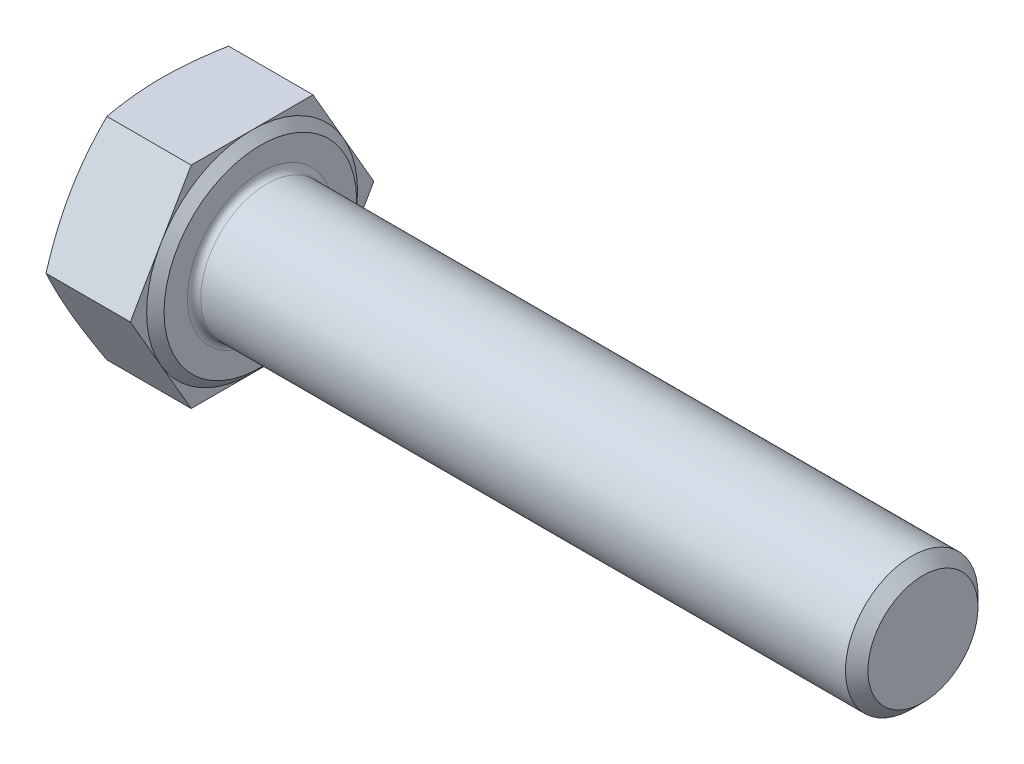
ISO-10303-21;
HEADER;
FILE_DESCRIPTION(('STEP AP214'),'2;1');
FILE_NAME('part.step','',(''),(''),'','','');
FILE_SCHEMA(('AUTOMOTIVE_DESIGN { 1 0 10303 214 1 1 1 1 }'));
ENDSEC;
DATA;
#1=APPLICATION_CONTEXT('core data for automotive mechanical design processes');
#2=APPLICATION_PROTOCOL_DEFINITION('international standard','automotive_design',2000,#1);
#3=PRODUCT_CONTEXT('',#1,'mechanical');
#4=PRODUCT('Part','Part','',(#3));
#5=PRODUCT_RELATED_PRODUCT_CATEGORY('part','',(#4));
#6=PRODUCT_DEFINITION_FORMATION('','',#4);
#7=PRODUCT_DEFINITION_CONTEXT('part definition',#1,'design');
#8=PRODUCT_DEFINITION('design','',#6,#7);
#9=PRODUCT_DEFINITION_SHAPE('','',#8);
#10=(LENGTH_UNIT() NAMED_UNIT(*) SI_UNIT(.MILLI.,.METRE.));
#11=(NAMED_UNIT(*) PLANE_ANGLE_UNIT() SI_UNIT($,.RADIAN.));
#12=(NAMED_UNIT(*) SI_UNIT($,.STERADIAN.) SOLID_ANGLE_UNIT());
#13=UNCERTAINTY_MEASURE_WITH_UNIT(LENGTH_MEASURE(1.E-05),#10,'distance_accuracy_value','');
#14=(GEOMETRIC_REPRESENTATION_CONTEXT(3) GLOBAL_UNCERTAINTY_ASSIGNED_CONTEXT((#13)) GLOBAL_UNIT_ASSIGNED_CONTEXT((#10,
#11,#12)) REPRESENTATION_CONTEXT('',''));
#15=CARTESIAN_POINT('',(0.,0.,0.));
#16=DIRECTION('',(0.,0.,1.));
#17=DIRECTION('',(1.,0.,0.));
#18=AXIS2_PLACEMENT_3D('',#15,#16,#17);
#19=CARTESIAN_POINT('',(5.95,0.,0.));
#20=DIRECTION('',(1.,0.,0.));
#21=DIRECTION('',(0.,0.,-1.));
#22=AXIS2_PLACEMENT_3D('',#19,#20,#21);
#23=PLANE('',#22);
#24=CARTESIAN_POINT('',(5.95,0.,0.));
#25=DIRECTION('',(1.,0.,0.));
#26=DIRECTION('',(0.,0.,-1.));
#27=AXIS2_PLACEMENT_3D('',#24,#25,#26);
#28=CIRCLE('',#27,4.4);
#29=CARTESIAN_POINT('',(5.95,0.,-4.4));
#30=VERTEX_POINT('',#29);
#31=EDGE_CURVE('E188',#30,#30,#28,.F.);
#32=ORIENTED_EDGE('',*,*,#31,.T.);
#33=EDGE_LOOP('',(#32));
#34=FACE_BOUND('',#33,.T.);
#35=CARTESIAN_POINT('',(5.95,0.,0.));
#36=DIRECTION('',(-1.,0.,0.));
#37=DIRECTION('',(0.,0.,1.));
#38=AXIS2_PLACEMENT_3D('',#35,#36,#37);
#39=CIRCLE('',#38,5.815);
#40=CARTESIAN_POINT('',(5.95,0.,5.815));
#41=VERTEX_POINT('',#40);
#42=EDGE_CURVE('E139',#41,#41,#39,.T.);
#43=ORIENTED_EDGE('',*,*,#42,.F.);
#44=EDGE_LOOP('',(#43));
#45=FACE_BOUND('',#44,.T.);
#46=ADVANCED_FACE('F33',(#34,#45),#23,.T.);
#47=CARTESIAN_POINT('',(5.45,0.,-7.34966892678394));
#48=DIRECTION('',(1.,0.,0.));
#49=DIRECTION('',(0.,0.,-1.));
#50=AXIS2_PLACEMENT_3D('',#47,#48,#49);
#51=PLANE('',#50);
#52=DIRECTION('',(0.,-0.866025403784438,0.5));
#53=VECTOR('',#52,1.);
#54=CARTESIAN_POINT('',(5.45,6.365,3.67483446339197));
#55=LINE('',#54,#53);
#56=CARTESIAN_POINT('',(5.45,6.365,3.67483446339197));
#57=VERTEX_POINT('',#56);
#58=CARTESIAN_POINT('',(5.45,3.1825,5.51225169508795));
#59=VERTEX_POINT('',#58);
#60=EDGE_CURVE('E138',#57,#59,#55,.T.);
#61=ORIENTED_EDGE('',*,*,#60,.T.);
#62=CARTESIAN_POINT('',(5.45,0.,0.));
#63=DIRECTION('',(-1.,0.,0.));
#64=DIRECTION('',(0.,0.,1.));
#65=AXIS2_PLACEMENT_3D('',#62,#63,#64);
#66=CIRCLE('',#65,6.365);
#67=CARTESIAN_POINT('',(5.45,6.365,0.));
#68=VERTEX_POINT('',#67);
#69=EDGE_CURVE('E49',#59,#68,#66,.T.);
#70=ORIENTED_EDGE('',*,*,#69,.T.);
#71=DIRECTION('',(0.,0.,1.));
#72=VECTOR('',#71,1.);
#73=CARTESIAN_POINT('',(5.45,6.365,-3.67483446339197));
#74=LINE('',#73,#72);
#75=EDGE_CURVE('E135',#68,#57,#74,.T.);
#76=ORIENTED_EDGE('',*,*,#75,.T.);
#77=EDGE_LOOP('',(#61,#70,#76));
#78=FACE_BOUND('',#77,.T.);
#79=ADVANCED_FACE('F134',(#78),#51,.T.);
#80=CARTESIAN_POINT('',(5.45,6.365,-3.67483446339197));
#81=VERTEX_POINT('',#80);
#82=EDGE_CURVE('E145',#81,#68,#74,.T.);
#83=ORIENTED_EDGE('',*,*,#82,.T.);
#84=CARTESIAN_POINT('',(5.45,3.1825,-5.51225169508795));
#85=VERTEX_POINT('',#84);
#86=EDGE_CURVE('E122',#68,#85,#66,.T.);
#87=ORIENTED_EDGE('',*,*,#86,.T.);
#88=DIRECTION('',(0.,0.866025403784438,0.5));
#89=VECTOR('',#88,1.);
#90=CARTESIAN_POINT('',(5.45,0.,-7.34966892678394));
#91=LINE('',#90,#89);
#92=EDGE_CURVE('E151',#85,#81,#91,.T.);
#93=ORIENTED_EDGE('',*,*,#92,.T.);
#94=EDGE_LOOP('',(#83,#87,#93));
#95=FACE_BOUND('',#94,.T.);
#96=ADVANCED_FACE('F150',(#95),#51,.T.);
#97=CARTESIAN_POINT('',(5.45,0.,-7.34966892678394));
#98=VERTEX_POINT('',#97);
#99=EDGE_CURVE('E148',#98,#85,#91,.T.);
#100=ORIENTED_EDGE('',*,*,#99,.T.);
#101=CARTESIAN_POINT('',(5.45,-3.1825,-5.51225169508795));
#102=VERTEX_POINT('',#101);
#103=EDGE_CURVE('E125',#85,#102,#66,.T.);
#104=ORIENTED_EDGE('',*,*,#103,.T.);
#105=DIRECTION('',(0.,0.866025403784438,-0.5));
#106=VECTOR('',#105,1.);
#107=CARTESIAN_POINT('',(5.45,-6.365,-3.67483446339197));
#108=LINE('',#107,#106);
#109=EDGE_CURVE('E306',#102,#98,#108,.T.);
#110=ORIENTED_EDGE('',*,*,#109,.T.);
#111=EDGE_LOOP('',(#100,#104,#110));
#112=FACE_BOUND('',#111,.T.);
#113=ADVANCED_FACE('F337',(#112),#51,.T.);
#114=CARTESIAN_POINT('',(5.45,-6.365,-3.67483446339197));
#115=VERTEX_POINT('',#114);
#116=EDGE_CURVE('E304',#115,#102,#108,.T.);
#117=ORIENTED_EDGE('',*,*,#116,.T.);
#118=CARTESIAN_POINT('',(5.45,-6.365,0.));
#119=VERTEX_POINT('',#118);
#120=EDGE_CURVE('E338',#102,#119,#66,.T.);
#121=ORIENTED_EDGE('',*,*,#120,.T.);
#122=DIRECTION('',(0.,0.,-1.));
#123=VECTOR('',#122,1.);
#124=CARTESIAN_POINT('',(5.45,-6.365,3.67483446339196));
#125=LINE('',#124,#123);
#126=EDGE_CURVE('E162',#119,#115,#125,.T.);
#127=ORIENTED_EDGE('',*,*,#126,.T.);
#128=EDGE_LOOP('',(#117,#121,#127));
#129=FACE_BOUND('',#128,.T.);
#130=ADVANCED_FACE('F352',(#129),#51,.T.);
#131=CARTESIAN_POINT('',(5.45,-6.365,3.67483446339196));
#132=VERTEX_POINT('',#131);
#133=EDGE_CURVE('E163',#132,#119,#125,.T.);
#134=ORIENTED_EDGE('',*,*,#133,.T.);
#135=CARTESIAN_POINT('',(5.45,-3.1825,5.51225169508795));
#136=VERTEX_POINT('',#135);
#137=EDGE_CURVE('E339',#119,#136,#66,.T.);
#138=ORIENTED_EDGE('',*,*,#137,.T.);
#139=DIRECTION('',(0.,-0.866025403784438,-0.5));
#140=VECTOR('',#139,1.);
#141=CARTESIAN_POINT('',(5.45,0.,7.34966892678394));
#142=LINE('',#141,#140);
#143=EDGE_CURVE('E158',#136,#132,#142,.T.);
#144=ORIENTED_EDGE('',*,*,#143,.T.);
#145=EDGE_LOOP('',(#134,#138,#144));
#146=FACE_BOUND('',#145,.T.);
#147=ADVANCED_FACE('F347',(#146),#51,.T.);
#148=CARTESIAN_POINT('',(5.45,0.,7.34966892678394));
#149=VERTEX_POINT('',#148);
#150=EDGE_CURVE('E159',#149,#136,#142,.T.);
#151=ORIENTED_EDGE('',*,*,#150,.T.);
#152=EDGE_CURVE('E140',#136,#59,#66,.T.);
#153=ORIENTED_EDGE('',*,*,#152,.T.);
#154=EDGE_CURVE('E153',#59,#149,#55,.T.);
#155=ORIENTED_EDGE('',*,*,#154,.T.);
#156=EDGE_LOOP('',(#151,#153,#155));
#157=FACE_BOUND('',#156,.T.);
#158=ADVANCED_FACE('F213',(#157),#51,.T.);
#159=CARTESIAN_POINT('',(5.45,-6.365,-3.67483446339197));
#160=DIRECTION('',(0.,0.5,0.866025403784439));
#161=DIRECTION('',(0.,-0.866025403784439,0.5));
#162=AXIS2_PLACEMENT_3D('',#159,#160,#161);
#163=PLANE('',#162);
#164=CARTESIAN_POINT('',(0.358432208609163,0.000200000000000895,-7.34978439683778));
#165=CARTESIAN_POINT('',(0.303017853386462,-0.263405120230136,-7.19759190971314));
#166=CARTESIAN_POINT('',(0.252608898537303,-0.52787949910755,-7.04489755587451));
#167=CARTESIAN_POINT('',(0.163922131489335,-1.05854790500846,-6.73851600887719));
#168=CARTESIAN_POINT('',(0.125653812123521,-1.3247431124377,-6.58482813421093));
#169=CARTESIAN_POINT('',(0.0637558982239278,-1.85589900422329,-6.27816513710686));
#170=CARTESIAN_POINT('',(0.0399912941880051,-2.12084755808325,-6.12519701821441));
#171=CARTESIAN_POINT('',(0.00811628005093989,-2.65136425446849,-5.81890306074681));
#172=CARTESIAN_POINT('',(0.,-2.91693212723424,-5.66557737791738));
#173=CARTESIAN_POINT('',(0.,-3.44806787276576,-5.35892601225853));
#174=CARTESIAN_POINT('',(0.00811628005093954,-3.71363574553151,-5.2056003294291));
#175=CARTESIAN_POINT('',(0.0399912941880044,-4.24415244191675,-4.89930637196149));
#176=CARTESIAN_POINT('',(0.0637558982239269,-4.50910099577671,-4.74633825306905));
#177=CARTESIAN_POINT('',(0.12565381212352,-5.0402568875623,-4.43967525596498));
#178=CARTESIAN_POINT('',(0.163922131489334,-5.30645209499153,-4.28598738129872));
#179=CARTESIAN_POINT('',(0.252608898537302,-5.83712050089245,-3.9796058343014));
#180=CARTESIAN_POINT('',(0.303017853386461,-6.10159487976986,-3.82691148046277));
#181=CARTESIAN_POINT('',(0.358432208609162,-6.3652,-3.67471899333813));
#182=B_SPLINE_CURVE_WITH_KNOTS('',3,(#164,#165,#166,#167,#168,#169,#170,#171,#172,#173,#174,
#175,#176,#177,#178,#179,#180,#181),.UNSPECIFIED.,.F.,.F.,(4,2,2,2,2,2,2,2,4),(0.,
0.928259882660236,1.85724379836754,2.77744274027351,3.69729643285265,4.6171501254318,
5.53734906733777,6.46633298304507,7.39459286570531),.UNSPECIFIED.);
#183=CARTESIAN_POINT('',(0.358390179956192,0.,-7.34966892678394));
#184=VERTEX_POINT('',#183);
#185=CARTESIAN_POINT('',(0.,-3.1825,-5.51225169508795));
#186=VERTEX_POINT('',#185);
#187=EDGE_CURVE('E321',#184,#186,#182,.T.);
#188=ORIENTED_EDGE('',*,*,#187,.F.);
#189=DIRECTION('',(-1.,0.,0.));
#190=VECTOR('',#189,1.);
#191=CARTESIAN_POINT('',(5.45,0.,-7.34966892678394));
#192=LINE('',#191,#190);
#193=EDGE_CURVE('E178',#98,#184,#192,.T.);
#194=ORIENTED_EDGE('',*,*,#193,.F.);
#195=ORIENTED_EDGE('',*,*,#109,.F.);
#196=ORIENTED_EDGE('',*,*,#116,.F.);
#197=DIRECTION('',(-1.,0.,0.));
#198=VECTOR('',#197,1.);
#199=CARTESIAN_POINT('',(5.45,-6.365,-3.67483446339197));
#200=LINE('',#199,#198);
#201=CARTESIAN_POINT('',(0.358390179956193,-6.365,-3.67483446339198));
#202=VERTEX_POINT('',#201);
#203=EDGE_CURVE('E166',#115,#202,#200,.T.);
#204=ORIENTED_EDGE('',*,*,#203,.T.);
#205=EDGE_CURVE('E246',#186,#202,#182,.T.);
#206=ORIENTED_EDGE('',*,*,#205,.F.);
#207=EDGE_LOOP('',(#188,#194,#195,#196,#204,#206));
#208=FACE_BOUND('',#207,.T.);
#209=ADVANCED_FACE('F35',(#208),#163,.F.);
#210=CARTESIAN_POINT('',(5.45,0.,-7.34966892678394));
#211=DIRECTION('',(0.,-0.5,0.866025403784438));
#212=DIRECTION('',(0.,-0.866025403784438,-0.500000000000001));
#213=AXIS2_PLACEMENT_3D('',#210,#211,#212);
#214=PLANE('',#213);
#215=CARTESIAN_POINT('',(0.358432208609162,6.3652,-3.67471899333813));
#216=CARTESIAN_POINT('',(0.303017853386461,6.10159487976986,-3.82691148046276));
#217=CARTESIAN_POINT('',(0.252608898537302,5.83712050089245,-3.9796058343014));
#218=CARTESIAN_POINT('',(0.163922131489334,5.30645209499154,-4.28598738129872));
#219=CARTESIAN_POINT('',(0.12565381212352,5.0402568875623,-4.43967525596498));
#220=CARTESIAN_POINT('',(0.0637558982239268,4.50910099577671,-4.74633825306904));
#221=CARTESIAN_POINT('',(0.0399912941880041,4.24415244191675,-4.89930637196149));
#222=CARTESIAN_POINT('',(0.00811628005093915,3.71363574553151,-5.2056003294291));
#223=CARTESIAN_POINT('',(0.,3.44806787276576,-5.35892601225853));
#224=CARTESIAN_POINT('',(0.,2.91693212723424,-5.66557737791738));
#225=CARTESIAN_POINT('',(0.00811628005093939,2.65136425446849,-5.8189030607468));
#226=CARTESIAN_POINT('',(0.0399912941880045,2.12084755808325,-6.12519701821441));
#227=CARTESIAN_POINT('',(0.0637558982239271,1.85589900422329,-6.27816513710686));
#228=CARTESIAN_POINT('',(0.12565381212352,1.3247431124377,-6.58482813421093));
#229=CARTESIAN_POINT('',(0.163922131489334,1.05854790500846,-6.73851600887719));
#230=CARTESIAN_POINT('',(0.252608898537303,0.527879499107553,-7.04489755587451));
#231=CARTESIAN_POINT('',(0.303017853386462,0.263405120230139,-7.19759190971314));
#232=CARTESIAN_POINT('',(0.358432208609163,-0.000199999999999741,-7.34978439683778));
#233=B_SPLINE_CURVE_WITH_KNOTS('',3,(#215,#216,#217,#218,#219,#220,#221,#222,#223,#224,#225,
#226,#227,#228,#229,#230,#231,#232),.UNSPECIFIED.,.F.,.F.,(4,2,2,2,2,2,2,2,4),(0.,
0.928259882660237,1.85724379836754,2.77744274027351,3.69729643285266,4.6171501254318,
5.53734906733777,6.46633298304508,7.39459286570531),.UNSPECIFIED.);
#234=CARTESIAN_POINT('',(0.358390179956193,6.365,-3.67483446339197));
#235=VERTEX_POINT('',#234);
#236=CARTESIAN_POINT('',(0.,3.1825,-5.51225169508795));
#237=VERTEX_POINT('',#236);
#238=EDGE_CURVE('E261',#235,#237,#233,.T.);
#239=ORIENTED_EDGE('',*,*,#238,.F.);
#240=DIRECTION('',(-1.,0.,0.));
#241=VECTOR('',#240,1.);
#242=CARTESIAN_POINT('',(5.45,6.365,-3.67483446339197));
#243=LINE('',#242,#241);
#244=EDGE_CURVE('E176',#81,#235,#243,.T.);
#245=ORIENTED_EDGE('',*,*,#244,.F.);
#246=ORIENTED_EDGE('',*,*,#92,.F.);
#247=ORIENTED_EDGE('',*,*,#99,.F.);
#248=ORIENTED_EDGE('',*,*,#193,.T.);
#249=EDGE_CURVE('E257',#237,#184,#233,.T.);
#250=ORIENTED_EDGE('',*,*,#249,.F.);
#251=EDGE_LOOP('',(#239,#245,#246,#247,#248,#250));
#252=FACE_BOUND('',#251,.T.);
#253=ADVANCED_FACE('F267',(#252),#214,.F.);
#254=CARTESIAN_POINT('',(5.45,6.365,-3.67483446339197));
#255=DIRECTION('',(0.,-1.,0.));
#256=DIRECTION('',(0.,0.,-1.));
#257=AXIS2_PLACEMENT_3D('',#254,#255,#256);
#258=PLANE('',#257);
#259=CARTESIAN_POINT('',(1.91509499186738,6.365,-9.72966949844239));
#260=CARTESIAN_POINT('',(1.8274065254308,6.365,-9.44169388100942));
#261=CARTESIAN_POINT('',(1.74074126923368,6.365,-9.15340090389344));
#262=CARTESIAN_POINT('',(1.57002321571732,6.365,-8.57601866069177));
#263=CARTESIAN_POINT('',(1.48597062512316,6.365,-8.28692933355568));
#264=CARTESIAN_POINT('',(1.32090412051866,6.365,-7.70729801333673));
#265=CARTESIAN_POINT('',(1.23989616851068,6.365,-7.41675431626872));
#266=CARTESIAN_POINT('',(1.08186732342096,6.365,-6.83458613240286));
#267=CARTESIAN_POINT('',(1.00484635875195,6.365,-6.54296166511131));
#268=CARTESIAN_POINT('',(0.856697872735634,6.365,-5.96204124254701));
#269=CARTESIAN_POINT('',(0.78550939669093,6.365,-5.67276090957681));
#270=CARTESIAN_POINT('',(0.649193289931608,6.365,-5.09276074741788));
#271=CARTESIAN_POINT('',(0.584065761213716,6.365,-4.80204089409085));
#272=CARTESIAN_POINT('',(0.46138993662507,6.365,-4.21909663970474));
#273=CARTESIAN_POINT('',(0.403839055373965,6.365,-3.92687278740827));
#274=CARTESIAN_POINT('',(0.298068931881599,6.365,-3.34072852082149));
#275=CARTESIAN_POINT('',(0.249849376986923,6.365,-3.04680816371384));
#276=CARTESIAN_POINT('',(0.169475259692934,6.365,-2.49036747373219));
#277=CARTESIAN_POINT('',(0.136125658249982,6.365,-2.22802137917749));
#278=CARTESIAN_POINT('',(0.0796727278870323,6.365,-1.7022198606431));
#279=CARTESIAN_POINT('',(0.0565691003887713,6.365,-1.43876446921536));
#280=CARTESIAN_POINT('',(0.0217207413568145,6.365,-0.911278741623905));
#281=CARTESIAN_POINT('',(0.00996797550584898,6.365,-0.647248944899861));
#282=CARTESIAN_POINT('',(-0.00158362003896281,6.365,-0.118925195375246));
#283=CARTESIAN_POINT('',(-0.00138253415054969,6.365,0.145368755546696));
#284=CARTESIAN_POINT('',(0.0109939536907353,6.365,0.67501258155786));
#285=CARTESIAN_POINT('',(0.0232300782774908,6.365,0.940361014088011));
#286=CARTESIAN_POINT('',(0.0591135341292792,6.365,1.4702784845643));
#287=CARTESIAN_POINT('',(0.0827611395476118,6.365,1.7348475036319));
#288=CARTESIAN_POINT('',(0.140361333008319,6.365,2.26307550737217));
#289=CARTESIAN_POINT('',(0.174322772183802,6.365,2.52673351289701));
#290=CARTESIAN_POINT('',(0.251173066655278,6.365,3.05273050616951));
#291=CARTESIAN_POINT('',(0.294061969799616,6.365,3.3150694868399));
#292=CARTESIAN_POINT('',(0.389839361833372,6.365,3.85223342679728));
#293=CARTESIAN_POINT('',(0.443136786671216,6.365,4.1269848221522));
#294=CARTESIAN_POINT('',(0.556591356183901,6.365,4.6750766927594));
#295=CARTESIAN_POINT('',(0.616749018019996,6.365,4.94841706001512));
#296=CARTESIAN_POINT('',(0.742660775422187,6.365,5.49388169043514));
#297=CARTESIAN_POINT('',(0.808416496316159,6.365,5.76600557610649));
#298=CARTESIAN_POINT('',(0.944455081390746,6.365,6.30910690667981));
#299=CARTESIAN_POINT('',(1.01473783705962,6.365,6.58008437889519));
#300=CARTESIAN_POINT('',(1.1590752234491,6.365,7.12140066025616));
#301=CARTESIAN_POINT('',(1.23313456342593,6.365,7.39173820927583));
#302=CARTESIAN_POINT('',(1.38427072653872,6.365,7.93157008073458));
#303=CARTESIAN_POINT('',(1.46134759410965,6.365,8.20106439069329));
#304=CARTESIAN_POINT('',(1.6962389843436,6.365,9.00837554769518));
#305=CARTESIAN_POINT('',(1.85774092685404,6.365,9.54511881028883));
#306=CARTESIAN_POINT('',(2.18566542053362,6.365,10.6106008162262));
#307=CARTESIAN_POINT('',(2.35201398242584,6.365,11.1393625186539));
#308=CARTESIAN_POINT('',(2.6894370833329,6.365,12.1954006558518));
#309=CARTESIAN_POINT('',(2.86051184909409,6.365,12.7226770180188));
#310=CARTESIAN_POINT('',(3.2054595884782,6.365,13.7740953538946));
#311=CARTESIAN_POINT('',(3.37931948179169,6.365,14.2982416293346));
#312=CARTESIAN_POINT('',(3.64203874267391,6.365,15.0837909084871));
#313=CARTESIAN_POINT('',(3.72992982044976,6.365,15.3455184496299));
#314=CARTESIAN_POINT('',(3.90628069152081,6.365,15.8687811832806));
#315=CARTESIAN_POINT('',(3.99474048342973,6.365,16.1303163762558));
#316=CARTESIAN_POINT('',(4.08344651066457,6.365,16.3917680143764));
#317=B_SPLINE_CURVE_WITH_KNOTS('',3,(#259,#260,#261,#262,#263,#264,#265,#266,#267,#268,#269,
#270,#271,#272,#273,#274,#275,#276,#277,#278,#279,#280,#281,#282,#283,#284,#285,#286,#287,#288,
#289,#290,#291,#292,#293,#294,#295,#296,#297,#298,#299,#300,#301,#302,#303,#304,#305,#306,#307,
#308,#309,#310,#311,#312,#313,#314,#315,#316),.UNSPECIFIED.,.F.,.F.,(4,2,2,2,2,2,2,2,2,2,2,2,2,
2,2,2,2,2,2,2,2,2,2,2,2,2,2,2,4),(0.,0.903097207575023,1.80626569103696,2.71111926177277,
3.61595658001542,4.50963771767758,5.40333389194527,6.29672431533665,7.19008479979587,
7.98328255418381,8.77645719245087,9.56906999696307,10.3616772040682,11.1583041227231,
11.9549501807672,12.7522818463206,13.5496177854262,14.3891296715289,15.2287048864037,
16.0685246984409,16.9083243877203,17.7491981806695,18.5900843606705,20.2715515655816,
21.9344590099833,23.5974463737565,25.2541238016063,26.0823957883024,26.9106657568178),.UNSPECIFIED.);
#318=CARTESIAN_POINT('',(0.358390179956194,6.36500000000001,3.67483446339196));
#319=VERTEX_POINT('',#318);
#320=CARTESIAN_POINT('',(0.,6.365,0.));
#321=VERTEX_POINT('',#320);
#322=EDGE_CURVE('E57',#319,#321,#317,.F.);
#323=ORIENTED_EDGE('',*,*,#322,.F.);
#324=DIRECTION('',(-1.,0.,0.));
#325=VECTOR('',#324,1.);
#326=CARTESIAN_POINT('',(5.45,6.365,3.67483446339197));
#327=LINE('',#326,#325);
#328=EDGE_CURVE('E147',#57,#319,#327,.T.);
#329=ORIENTED_EDGE('',*,*,#328,.F.);
#330=ORIENTED_EDGE('',*,*,#75,.F.);
#331=ORIENTED_EDGE('',*,*,#82,.F.);
#332=ORIENTED_EDGE('',*,*,#244,.T.);
#333=EDGE_CURVE('E262',#321,#235,#317,.F.);
#334=ORIENTED_EDGE('',*,*,#333,.F.);
#335=EDGE_LOOP('',(#323,#329,#330,#331,#332,#334));
#336=FACE_BOUND('',#335,.T.);
#337=ADVANCED_FACE('F143',(#336),#258,.F.);
#338=CARTESIAN_POINT('',(5.45,6.365,3.67483446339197));
#339=DIRECTION('',(0.,-0.5,-0.866025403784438));
#340=DIRECTION('',(0.,0.866025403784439,-0.5));
#341=AXIS2_PLACEMENT_3D('',#338,#339,#340);
#342=PLANE('',#341);
#343=CARTESIAN_POINT('',(0.358432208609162,-0.000199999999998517,7.34978439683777));
#344=CARTESIAN_POINT('',(0.303017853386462,0.26340512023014,7.19759190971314));
#345=CARTESIAN_POINT('',(0.252608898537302,0.527879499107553,7.04489755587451));
#346=CARTESIAN_POINT('',(0.163922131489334,1.05854790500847,6.73851600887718));
#347=CARTESIAN_POINT('',(0.12565381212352,1.3247431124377,6.58482813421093));
#348=CARTESIAN_POINT('',(0.0637558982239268,1.85589900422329,6.27816513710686));
#349=CARTESIAN_POINT('',(0.0399912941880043,2.12084755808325,6.12519701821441));
#350=CARTESIAN_POINT('',(0.00811628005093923,2.65136425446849,5.8189030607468));
#351=CARTESIAN_POINT('',(0.,2.91693212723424,5.66557737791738));
#352=CARTESIAN_POINT('',(0.,3.44806787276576,5.35892601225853));
#353=CARTESIAN_POINT('',(0.00811628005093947,3.71363574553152,5.2056003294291));
#354=CARTESIAN_POINT('',(0.0399912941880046,4.24415244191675,4.89930637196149));
#355=CARTESIAN_POINT('',(0.063755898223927,4.50910099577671,4.74633825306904));
#356=CARTESIAN_POINT('',(0.12565381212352,5.0402568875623,4.43967525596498));
#357=CARTESIAN_POINT('',(0.163922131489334,5.30645209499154,4.28598738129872));
#358=CARTESIAN_POINT('',(0.252608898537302,5.83712050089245,3.9796058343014));
#359=CARTESIAN_POINT('',(0.303017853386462,6.10159487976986,3.82691148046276));
#360=CARTESIAN_POINT('',(0.358432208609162,6.3652,3.67471899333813));
#361=B_SPLINE_CURVE_WITH_KNOTS('',3,(#343,#344,#345,#346,#347,#348,#349,#350,#351,#352,#353,
#354,#355,#356,#357,#358,#359,#360),.UNSPECIFIED.,.F.,.F.,(4,2,2,2,2,2,2,2,4),(0.,
0.928259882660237,1.85724379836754,2.77744274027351,3.69729643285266,4.6171501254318,
5.53734906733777,6.46633298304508,7.39459286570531),.UNSPECIFIED.);
#362=CARTESIAN_POINT('',(0.358390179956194,0.,7.34966892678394));
#363=VERTEX_POINT('',#362);
#364=CARTESIAN_POINT('',(0.,3.1825,5.51225169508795));
#365=VERTEX_POINT('',#364);
#366=EDGE_CURVE('E251',#363,#365,#361,.T.);
#367=ORIENTED_EDGE('',*,*,#366,.F.);
#368=DIRECTION('',(-1.,0.,0.));
#369=VECTOR('',#368,1.);
#370=CARTESIAN_POINT('',(5.45,0.,7.34966892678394));
#371=LINE('',#370,#369);
#372=EDGE_CURVE('E172',#149,#363,#371,.T.);
#373=ORIENTED_EDGE('',*,*,#372,.F.);
#374=ORIENTED_EDGE('',*,*,#154,.F.);
#375=ORIENTED_EDGE('',*,*,#60,.F.);
#376=ORIENTED_EDGE('',*,*,#328,.T.);
#377=EDGE_CURVE('E312',#365,#319,#361,.T.);
#378=ORIENTED_EDGE('',*,*,#377,.F.);
#379=EDGE_LOOP('',(#367,#373,#374,#375,#376,#378));
#380=FACE_BOUND('',#379,.T.);
#381=ADVANCED_FACE('F273',(#380),#342,.F.);
#382=CARTESIAN_POINT('',(5.45,0.,7.34966892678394));
#383=DIRECTION('',(0.,0.5,-0.866025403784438));
#384=DIRECTION('',(0.,0.866025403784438,0.5));
#385=AXIS2_PLACEMENT_3D('',#382,#383,#384);
#386=PLANE('',#385);
#387=CARTESIAN_POINT('',(0.358432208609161,-6.3652,3.67471899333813));
#388=CARTESIAN_POINT('',(0.30301785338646,-6.10159487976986,3.82691148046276));
#389=CARTESIAN_POINT('',(0.252608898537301,-5.83712050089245,3.97960583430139));
#390=CARTESIAN_POINT('',(0.163922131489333,-5.30645209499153,4.28598738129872));
#391=CARTESIAN_POINT('',(0.125653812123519,-5.0402568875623,4.43967525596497));
#392=CARTESIAN_POINT('',(0.0637558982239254,-4.50910099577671,4.74633825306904));
#393=CARTESIAN_POINT('',(0.039991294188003,-4.24415244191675,4.89930637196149));
#394=CARTESIAN_POINT('',(0.00811628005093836,-3.71363574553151,5.2056003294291));
#395=CARTESIAN_POINT('',(0.,-3.44806787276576,5.35892601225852));
#396=CARTESIAN_POINT('',(0.,-2.91693212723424,5.66557737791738));
#397=CARTESIAN_POINT('',(0.00811628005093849,-2.65136425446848,5.8189030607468));
#398=CARTESIAN_POINT('',(0.0399912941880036,-2.12084755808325,6.12519701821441));
#399=CARTESIAN_POINT('',(0.0637558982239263,-1.85589900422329,6.27816513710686));
#400=CARTESIAN_POINT('',(0.12565381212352,-1.3247431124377,6.58482813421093));
#401=CARTESIAN_POINT('',(0.163922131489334,-1.05854790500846,6.73851600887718));
#402=CARTESIAN_POINT('',(0.252608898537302,-0.52787949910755,7.04489755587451));
#403=CARTESIAN_POINT('',(0.303017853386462,-0.263405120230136,7.19759190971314));
#404=CARTESIAN_POINT('',(0.358432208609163,0.000200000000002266,7.34978439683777));
#405=B_SPLINE_CURVE_WITH_KNOTS('',3,(#387,#388,#389,#390,#391,#392,#393,#394,#395,#396,#397,
#398,#399,#400,#401,#402,#403,#404),.UNSPECIFIED.,.F.,.F.,(4,2,2,2,2,2,2,2,4),(0.,
0.928259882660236,1.85724379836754,2.77744274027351,3.69729643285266,4.6171501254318,
5.53734906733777,6.46633298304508,7.39459286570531),.UNSPECIFIED.);
#406=CARTESIAN_POINT('',(0.358390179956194,-6.365,3.67483446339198));
#407=VERTEX_POINT('',#406);
#408=CARTESIAN_POINT('',(0.,-3.1825,5.51225169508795));
#409=VERTEX_POINT('',#408);
#410=EDGE_CURVE('E239',#407,#409,#405,.T.);
#411=ORIENTED_EDGE('',*,*,#410,.F.);
#412=DIRECTION('',(-1.,0.,0.));
#413=VECTOR('',#412,1.);
#414=CARTESIAN_POINT('',(5.45,-6.365,3.67483446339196));
#415=LINE('',#414,#413);
#416=EDGE_CURVE('E169',#132,#407,#415,.T.);
#417=ORIENTED_EDGE('',*,*,#416,.F.);
#418=ORIENTED_EDGE('',*,*,#143,.F.);
#419=ORIENTED_EDGE('',*,*,#150,.F.);
#420=ORIENTED_EDGE('',*,*,#372,.T.);
#421=EDGE_CURVE('E317',#409,#363,#405,.T.);
#422=ORIENTED_EDGE('',*,*,#421,.F.);
#423=EDGE_LOOP('',(#411,#417,#418,#419,#420,#422));
#424=FACE_BOUND('',#423,.T.);
#425=ADVANCED_FACE('F276',(#424),#386,.F.);
#426=CARTESIAN_POINT('',(5.45,-6.365,3.67483446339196));
#427=DIRECTION('',(0.,1.,0.));
#428=DIRECTION('',(0.,0.,1.));
#429=AXIS2_PLACEMENT_3D('',#426,#427,#428);
#430=PLANE('',#429);
#431=CARTESIAN_POINT('',(1.91509499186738,-6.365,-9.72966949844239));
#432=CARTESIAN_POINT('',(1.8274065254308,-6.365,-9.44169388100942));
#433=CARTESIAN_POINT('',(1.74074126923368,-6.365,-9.15340090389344));
#434=CARTESIAN_POINT('',(1.57002321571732,-6.365,-8.57601866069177));
#435=CARTESIAN_POINT('',(1.48597062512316,-6.365,-8.28692933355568));
#436=CARTESIAN_POINT('',(1.32090412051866,-6.365,-7.70729801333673));
#437=CARTESIAN_POINT('',(1.23989616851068,-6.365,-7.41675431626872));
#438=CARTESIAN_POINT('',(1.08186732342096,-6.365,-6.83458613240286));
#439=CARTESIAN_POINT('',(1.00484635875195,-6.365,-6.54296166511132));
#440=CARTESIAN_POINT('',(0.856697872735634,-6.365,-5.96204124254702));
#441=CARTESIAN_POINT('',(0.78550939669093,-6.365,-5.67276090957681));
#442=CARTESIAN_POINT('',(0.649193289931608,-6.365,-5.09276074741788));
#443=CARTESIAN_POINT('',(0.584065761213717,-6.365,-4.80204089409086));
#444=CARTESIAN_POINT('',(0.461389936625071,-6.365,-4.21909663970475));
#445=CARTESIAN_POINT('',(0.403839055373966,-6.365,-3.92687278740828));
#446=CARTESIAN_POINT('',(0.298068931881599,-6.365,-3.3407285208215));
#447=CARTESIAN_POINT('',(0.249849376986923,-6.365,-3.04680816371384));
#448=CARTESIAN_POINT('',(0.169475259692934,-6.365,-2.4903674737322));
#449=CARTESIAN_POINT('',(0.136125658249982,-6.365,-2.2280213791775));
#450=CARTESIAN_POINT('',(0.0796727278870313,-6.365,-1.70221986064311));
#451=CARTESIAN_POINT('',(0.0565691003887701,-6.365,-1.43876446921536));
#452=CARTESIAN_POINT('',(0.0217207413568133,-6.365,-0.911278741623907));
#453=CARTESIAN_POINT('',(0.00996797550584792,-6.365,-0.647248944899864));
#454=CARTESIAN_POINT('',(-0.00158362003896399,-6.365,-0.118925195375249));
#455=CARTESIAN_POINT('',(-0.0013825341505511,-6.365,0.145368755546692));
#456=CARTESIAN_POINT('',(0.0109939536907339,-6.365,0.675012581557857));
#457=CARTESIAN_POINT('',(0.0232300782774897,-6.365,0.940361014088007));
#458=CARTESIAN_POINT('',(0.0591135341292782,-6.365,1.4702784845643));
#459=CARTESIAN_POINT('',(0.0827611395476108,-6.365,1.73484750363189));
#460=CARTESIAN_POINT('',(0.140361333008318,-6.365,2.26307550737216));
#461=CARTESIAN_POINT('',(0.174322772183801,-6.365,2.52673351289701));
#462=CARTESIAN_POINT('',(0.251173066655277,-6.365,3.05273050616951));
#463=CARTESIAN_POINT('',(0.294061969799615,-6.365,3.3150694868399));
#464=CARTESIAN_POINT('',(0.389839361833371,-6.365,3.85223342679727));
#465=CARTESIAN_POINT('',(0.443136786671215,-6.365,4.1269848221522));
#466=CARTESIAN_POINT('',(0.556591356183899,-6.365,4.6750766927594));
#467=CARTESIAN_POINT('',(0.616749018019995,-6.365,4.94841706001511));
#468=CARTESIAN_POINT('',(0.742660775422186,-6.365,5.49388169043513));
#469=CARTESIAN_POINT('',(0.808416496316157,-6.365,5.76600557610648));
#470=CARTESIAN_POINT('',(0.944455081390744,-6.365,6.3091069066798));
#471=CARTESIAN_POINT('',(1.01473783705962,-6.365,6.58008437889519));
#472=CARTESIAN_POINT('',(1.1590752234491,-6.365,7.12140066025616));
#473=CARTESIAN_POINT('',(1.23313456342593,-6.365,7.39173820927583));
#474=CARTESIAN_POINT('',(1.38427072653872,-6.365,7.93157008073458));
#475=CARTESIAN_POINT('',(1.46134759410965,-6.365,8.20106439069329));
#476=CARTESIAN_POINT('',(1.6962389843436,-6.365,9.00837554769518));
#477=CARTESIAN_POINT('',(1.85774092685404,-6.365,9.54511881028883));
#478=CARTESIAN_POINT('',(2.18566542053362,-6.365,10.6106008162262));
#479=CARTESIAN_POINT('',(2.35201398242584,-6.365,11.1393625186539));
#480=CARTESIAN_POINT('',(2.6894370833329,-6.365,12.1954006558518));
#481=CARTESIAN_POINT('',(2.86051184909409,-6.365,12.7226770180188));
#482=CARTESIAN_POINT('',(3.2054595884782,-6.365,13.7740953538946));
#483=CARTESIAN_POINT('',(3.37931948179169,-6.365,14.2982416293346));
#484=CARTESIAN_POINT('',(3.64203874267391,-6.365,15.0837909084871));
#485=CARTESIAN_POINT('',(3.72992982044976,-6.365,15.3455184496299));
#486=CARTESIAN_POINT('',(3.9062806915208,-6.365,15.8687811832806));
#487=CARTESIAN_POINT('',(3.99474048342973,-6.365,16.1303163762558));
#488=CARTESIAN_POINT('',(4.08344651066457,-6.365,16.3917680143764));
#489=B_SPLINE_CURVE_WITH_KNOTS('',3,(#431,#432,#433,#434,#435,#436,#437,#438,#439,#440,#441,
#442,#443,#444,#445,#446,#447,#448,#449,#450,#451,#452,#453,#454,#455,#456,#457,#458,#459,#460,
#461,#462,#463,#464,#465,#466,#467,#468,#469,#470,#471,#472,#473,#474,#475,#476,#477,#478,#479,
#480,#481,#482,#483,#484,#485,#486,#487,#488),.UNSPECIFIED.,.F.,.F.,(4,2,2,2,2,2,2,2,2,2,2,2,2,
2,2,2,2,2,2,2,2,2,2,2,2,2,2,2,4),(0.,0.903097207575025,1.80626569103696,2.71111926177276,
3.61595658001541,4.50963771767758,5.40333389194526,6.29672431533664,7.19008479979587,
7.98328255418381,8.77645719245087,9.56906999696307,10.3616772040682,11.1583041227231,
11.9549501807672,12.7522818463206,13.5496177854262,14.3891296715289,15.2287048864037,
16.0685246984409,16.9083243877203,17.7491981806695,18.5900843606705,20.2715515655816,
21.9344590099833,23.5974463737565,25.2541238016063,26.0823957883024,26.9106657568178),.UNSPECIFIED.);
#490=CARTESIAN_POINT('',(0.,-6.365,0.));
#491=VERTEX_POINT('',#490);
#492=EDGE_CURVE('E295',#202,#491,#489,.T.);
#493=ORIENTED_EDGE('',*,*,#492,.F.);
#494=ORIENTED_EDGE('',*,*,#203,.F.);
#495=ORIENTED_EDGE('',*,*,#126,.F.);
#496=ORIENTED_EDGE('',*,*,#133,.F.);
#497=ORIENTED_EDGE('',*,*,#416,.T.);
#498=EDGE_CURVE('E229',#491,#407,#489,.T.);
#499=ORIENTED_EDGE('',*,*,#498,.F.);
#500=EDGE_LOOP('',(#493,#494,#495,#496,#497,#499));
#501=FACE_BOUND('',#500,.T.);
#502=ADVANCED_FACE('F280',(#501),#430,.F.);
#503=CARTESIAN_POINT('',(0.,0.,0.));
#504=DIRECTION('',(1.,0.,0.));
#505=DIRECTION('',(0.,0.,-1.));
#506=AXIS2_PLACEMENT_3D('',#503,#504,#505);
#507=CONICAL_SURFACE('',#506,6.365,1.22173047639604);
#508=ORIENTED_EDGE('',*,*,#249,.T.);
#509=ORIENTED_EDGE('',*,*,#187,.T.);
#510=CARTESIAN_POINT('',(0.,0.,0.));
#511=DIRECTION('',(1.,0.,0.));
#512=DIRECTION('',(0.,0.,-1.));
#513=AXIS2_PLACEMENT_3D('',#510,#511,#512);
#514=CIRCLE('',#513,6.365);
#515=EDGE_CURVE('E181',#186,#237,#514,.T.);
#516=ORIENTED_EDGE('',*,*,#515,.T.);
#517=EDGE_LOOP('',(#508,#509,#516));
#518=FACE_BOUND('',#517,.T.);
#519=ADVANCED_FACE('F284',(#518),#507,.T.);
#520=ORIENTED_EDGE('',*,*,#205,.T.);
#521=ORIENTED_EDGE('',*,*,#492,.T.);
#522=EDGE_CURVE('E184',#491,#186,#514,.T.);
#523=ORIENTED_EDGE('',*,*,#522,.T.);
#524=EDGE_LOOP('',(#520,#521,#523));
#525=FACE_BOUND('',#524,.T.);
#526=ADVANCED_FACE('F289',(#525),#507,.T.);
#527=ORIENTED_EDGE('',*,*,#410,.T.);
#528=EDGE_CURVE('E330',#409,#491,#514,.T.);
#529=ORIENTED_EDGE('',*,*,#528,.T.);
#530=ORIENTED_EDGE('',*,*,#498,.T.);
#531=EDGE_LOOP('',(#527,#529,#530));
#532=FACE_BOUND('',#531,.T.);
#533=ADVANCED_FACE('F224',(#532),#507,.T.);
#534=ORIENTED_EDGE('',*,*,#366,.T.);
#535=EDGE_CURVE('E336',#365,#409,#514,.T.);
#536=ORIENTED_EDGE('',*,*,#535,.T.);
#537=ORIENTED_EDGE('',*,*,#421,.T.);
#538=EDGE_LOOP('',(#534,#536,#537));
#539=FACE_BOUND('',#538,.T.);
#540=ADVANCED_FACE('F223',(#539),#507,.T.);
#541=ORIENTED_EDGE('',*,*,#322,.T.);
#542=CARTESIAN_POINT('',(0.,0.,0.));
#543=DIRECTION('',(-1.,0.,0.));
#544=DIRECTION('',(0.,0.,1.));
#545=AXIS2_PLACEMENT_3D('',#542,#543,#544);
#546=CIRCLE('',#545,6.365);
#547=EDGE_CURVE('E335',#365,#321,#546,.T.);
#548=ORIENTED_EDGE('',*,*,#547,.F.);
#549=ORIENTED_EDGE('',*,*,#377,.T.);
#550=EDGE_LOOP('',(#541,#548,#549));
#551=FACE_BOUND('',#550,.T.);
#552=ADVANCED_FACE('F218',(#551),#507,.T.);
#553=ORIENTED_EDGE('',*,*,#333,.T.);
#554=ORIENTED_EDGE('',*,*,#238,.T.);
#555=EDGE_CURVE('E185',#237,#321,#514,.T.);
#556=ORIENTED_EDGE('',*,*,#555,.T.);
#557=EDGE_LOOP('',(#553,#554,#556));
#558=FACE_BOUND('',#557,.T.);
#559=ADVANCED_FACE('F222',(#558),#507,.T.);
#560=CARTESIAN_POINT('',(0.,0.,-7.34966892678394));
#561=DIRECTION('',(1.,0.,0.));
#562=DIRECTION('',(0.,0.,-1.));
#563=AXIS2_PLACEMENT_3D('',#560,#561,#562);
#564=PLANE('',#563);
#565=ORIENTED_EDGE('',*,*,#555,.F.);
#566=ORIENTED_EDGE('',*,*,#515,.F.);
#567=ORIENTED_EDGE('',*,*,#522,.F.);
#568=ORIENTED_EDGE('',*,*,#528,.F.);
#569=ORIENTED_EDGE('',*,*,#535,.F.);
#570=ORIENTED_EDGE('',*,*,#547,.T.);
#571=EDGE_LOOP('',(#565,#566,#567,#568,#569,#570));
#572=FACE_BOUND('',#571,.T.);
#573=ADVANCED_FACE('F225',(#572),#564,.F.);
#574=CARTESIAN_POINT('',(5.45,0.,0.));
#575=DIRECTION('',(-1.,0.,0.));
#576=DIRECTION('',(0.,0.,1.));
#577=AXIS2_PLACEMENT_3D('',#574,#575,#576);
#578=CONICAL_SURFACE('',#577,6.365,0.832981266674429);
#579=ORIENTED_EDGE('',*,*,#42,.T.);
#580=EDGE_LOOP('',(#579));
#581=FACE_BOUND('',#580,.T.);
#582=ORIENTED_EDGE('',*,*,#69,.F.);
#583=ORIENTED_EDGE('',*,*,#152,.F.);
#584=ORIENTED_EDGE('',*,*,#137,.F.);
#585=ORIENTED_EDGE('',*,*,#120,.F.);
#586=ORIENTED_EDGE('',*,*,#103,.F.);
#587=ORIENTED_EDGE('',*,*,#86,.F.);
#588=EDGE_LOOP('',(#582,#583,#584,#585,#586,#587));
#589=FACE_BOUND('',#588,.T.);
#590=ADVANCED_FACE('F123',(#581,#589),#578,.T.);
#591=CARTESIAN_POINT('',(45.95,0.,0.));
#592=DIRECTION('',(-1.,0.,0.));
#593=DIRECTION('',(0.,0.,1.));
#594=AXIS2_PLACEMENT_3D('',#591,#592,#593);
#595=CYLINDRICAL_SURFACE('',#594,4.);
#596=CARTESIAN_POINT('',(45.2735,0.,0.));
#597=DIRECTION('',(1.,0.,0.));
#598=DIRECTION('',(0.,0.,-1.));
#599=AXIS2_PLACEMENT_3D('',#596,#597,#598);
#600=CIRCLE('',#599,4.);
#601=CARTESIAN_POINT('',(45.2735,0.,-4.00000000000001));
#602=VERTEX_POINT('',#601);
#603=EDGE_CURVE('E12',#602,#602,#600,.F.);
#604=ORIENTED_EDGE('',*,*,#603,.T.);
#605=EDGE_LOOP('',(#604));
#606=FACE_BOUND('',#605,.T.);
#607=CARTESIAN_POINT('',(6.35,0.,0.));
#608=DIRECTION('',(1.,0.,0.));
#609=DIRECTION('',(0.,0.,-1.));
#610=AXIS2_PLACEMENT_3D('',#607,#608,#609);
#611=CIRCLE('',#610,4.);
#612=CARTESIAN_POINT('',(6.35,0.,-4.));
#613=VERTEX_POINT('',#612);
#614=EDGE_CURVE('E129',#613,#613,#611,.T.);
#615=ORIENTED_EDGE('',*,*,#614,.T.);
#616=EDGE_LOOP('',(#615));
#617=FACE_BOUND('',#616,.T.);
#618=ADVANCED_FACE('F454',(#606,#617),#595,.T.);
#619=CARTESIAN_POINT('',(45.95,0.,0.));
#620=DIRECTION('',(1.,0.,0.));
#621=DIRECTION('',(0.,0.,-1.));
#622=AXIS2_PLACEMENT_3D('',#619,#620,#621);
#623=PLANE('',#622);
#624=CARTESIAN_POINT('',(45.95,0.,0.));
#625=DIRECTION('',(1.,0.,0.));
#626=DIRECTION('',(0.,0.,-1.));
#627=AXIS2_PLACEMENT_3D('',#624,#625,#626);
#628=CIRCLE('',#627,3.32350000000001);
#629=CARTESIAN_POINT('',(45.95,0.,-3.32350000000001));
#630=VERTEX_POINT('',#629);
#631=EDGE_CURVE('E42',#630,#630,#628,.T.);
#632=ORIENTED_EDGE('',*,*,#631,.T.);
#633=EDGE_LOOP('',(#632));
#634=FACE_BOUND('',#633,.T.);
#635=ADVANCED_FACE('F193',(#634),#623,.T.);
#636=CARTESIAN_POINT('',(6.35,0.,0.));
#637=DIRECTION('',(1.,0.,0.));
#638=DIRECTION('',(0.,0.,-1.));
#639=AXIS2_PLACEMENT_3D('',#636,#637,#638);
#640=TOROIDAL_SURFACE('',#639,4.4,0.4);
#641=ORIENTED_EDGE('',*,*,#31,.F.);
#642=EDGE_LOOP('',(#641));
#643=FACE_BOUND('',#642,.T.);
#644=ORIENTED_EDGE('',*,*,#614,.F.);
#645=EDGE_LOOP('',(#644));
#646=FACE_BOUND('',#645,.T.);
#647=ADVANCED_FACE('F197',(#643,#646),#640,.F.);
#648=CARTESIAN_POINT('',(45.95,0.,0.));
#649=DIRECTION('',(-1.,0.,0.));
#650=DIRECTION('',(0.,0.,1.));
#651=AXIS2_PLACEMENT_3D('',#648,#649,#650);
#652=CONICAL_SURFACE('',#651,3.32350000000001,0.785398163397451);
#653=ORIENTED_EDGE('',*,*,#603,.F.);
#654=EDGE_LOOP('',(#653));
#655=FACE_BOUND('',#654,.T.);
#656=ORIENTED_EDGE('',*,*,#631,.F.);
#657=EDGE_LOOP('',(#656));
#658=FACE_BOUND('',#657,.T.);
#659=ADVANCED_FACE('F195',(#655,#658),#652,.T.);
#660=CLOSED_SHELL('',(#46,#79,#96,#113,#130,#147,#158,#209,#253,#337,#381,#425,#502,#519,#526,
#533,#540,#552,#559,#573,#590,#618,#635,#647,#659));
#661=MANIFOLD_SOLID_BREP('B2',#660);
#662=ADVANCED_BREP_SHAPE_REPRESENTATION('',(#18,#661),#14);
#663=SHAPE_DEFINITION_REPRESENTATION(#9,#662);
ENDSEC;
END-ISO-10303-21;
